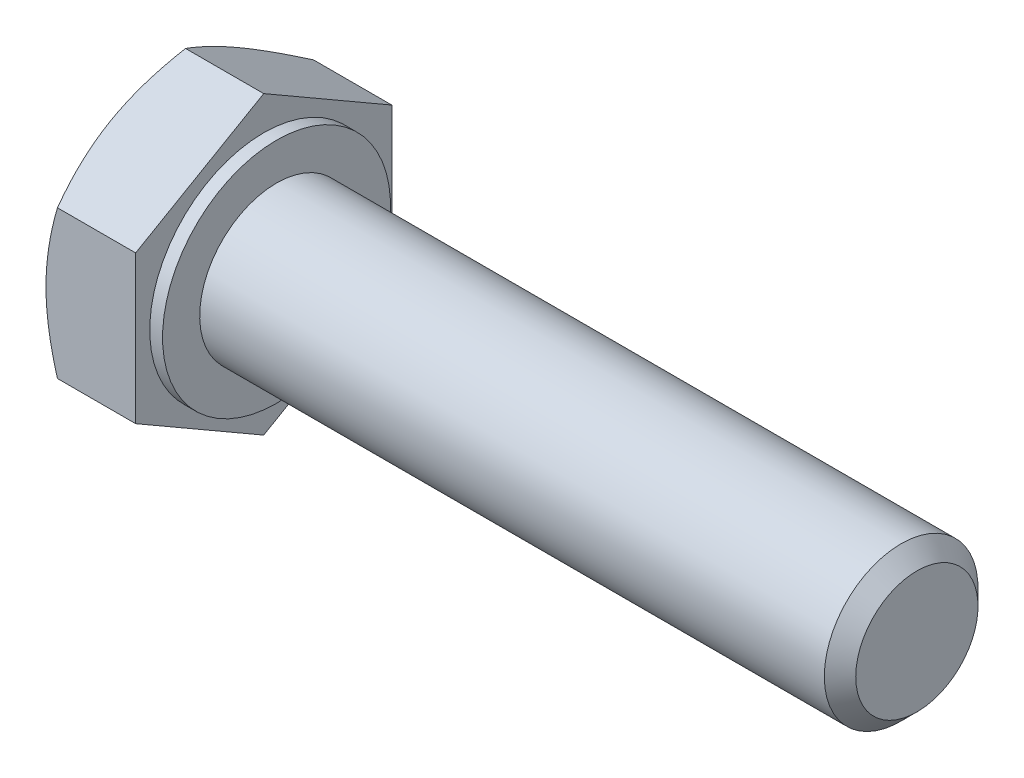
ISO-10303-21;
HEADER;
FILE_DESCRIPTION(('STEP AP214'),'2;1');
FILE_NAME('part.step','',(''),(''),'','','');
FILE_SCHEMA(('AUTOMOTIVE_DESIGN { 1 0 10303 214 1 1 1 1 }'));
ENDSEC;
DATA;
#1=APPLICATION_CONTEXT('core data for automotive mechanical design processes');
#2=APPLICATION_PROTOCOL_DEFINITION('international standard','automotive_design',2000,#1);
#3=PRODUCT_CONTEXT('',#1,'mechanical');
#4=PRODUCT('Part','Part','',(#3));
#5=PRODUCT_RELATED_PRODUCT_CATEGORY('part','',(#4));
#6=PRODUCT_DEFINITION_FORMATION('','',#4);
#7=PRODUCT_DEFINITION_CONTEXT('part definition',#1,'design');
#8=PRODUCT_DEFINITION('design','',#6,#7);
#9=PRODUCT_DEFINITION_SHAPE('','',#8);
#10=(LENGTH_UNIT() NAMED_UNIT(*) SI_UNIT(.MILLI.,.METRE.));
#11=(NAMED_UNIT(*) PLANE_ANGLE_UNIT() SI_UNIT($,.RADIAN.));
#12=(NAMED_UNIT(*) SI_UNIT($,.STERADIAN.) SOLID_ANGLE_UNIT());
#13=UNCERTAINTY_MEASURE_WITH_UNIT(LENGTH_MEASURE(1.E-05),#10,'distance_accuracy_value','');
#14=(GEOMETRIC_REPRESENTATION_CONTEXT(3) GLOBAL_UNCERTAINTY_ASSIGNED_CONTEXT((#13)) GLOBAL_UNIT_ASSIGNED_CONTEXT((#10,
#11,#12)) REPRESENTATION_CONTEXT('',''));
#15=CARTESIAN_POINT('',(0.,0.,0.));
#16=DIRECTION('',(0.,0.,1.));
#17=DIRECTION('',(1.,0.,0.));
#18=AXIS2_PLACEMENT_3D('',#15,#16,#17);
#19=CARTESIAN_POINT('',(-4.00009999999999,0.,0.));
#20=DIRECTION('',(1.,0.,0.));
#21=DIRECTION('',(0.,0.,-1.));
#22=AXIS2_PLACEMENT_3D('',#19,#20,#21);
#23=PLANE('',#22);
#24=CARTESIAN_POINT('',(-4.00010000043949,0.,0.));
#25=DIRECTION('',(1.,0.,0.));
#26=DIRECTION('',(0.,0.,-1.));
#27=AXIS2_PLACEMENT_3D('',#24,#25,#26);
#28=CIRCLE('',#27,5.00000000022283);
#29=CARTESIAN_POINT('',(-4.00010000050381,4.33012701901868,-2.5000000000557));
#30=VERTEX_POINT('',#29);
#31=CARTESIAN_POINT('',(-4.00010000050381,4.33012701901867,2.50000000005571));
#32=VERTEX_POINT('',#31);
#33=EDGE_CURVE('E322',#30,#32,#28,.T.);
#34=ORIENTED_EDGE('',*,*,#33,.F.);
#35=CARTESIAN_POINT('',(-4.00010000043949,0.,0.));
#36=DIRECTION('',(1.,0.,0.));
#37=DIRECTION('',(0.,0.,-1.));
#38=AXIS2_PLACEMENT_3D('',#35,#36,#37);
#39=CIRCLE('',#38,5.00000000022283);
#40=CARTESIAN_POINT('',(-4.00010000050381,0.,-5.00000000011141));
#41=VERTEX_POINT('',#40);
#42=EDGE_CURVE('E318',#41,#30,#39,.T.);
#43=ORIENTED_EDGE('',*,*,#42,.F.);
#44=CARTESIAN_POINT('',(-4.00010000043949,0.,0.));
#45=DIRECTION('',(1.,0.,0.));
#46=DIRECTION('',(0.,0.,-1.));
#47=AXIS2_PLACEMENT_3D('',#44,#45,#46);
#48=CIRCLE('',#47,5.00000000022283);
#49=CARTESIAN_POINT('',(-4.00010000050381,-4.33012701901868,-2.50000000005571));
#50=VERTEX_POINT('',#49);
#51=EDGE_CURVE('E314',#50,#41,#48,.T.);
#52=ORIENTED_EDGE('',*,*,#51,.F.);
#53=CARTESIAN_POINT('',(-4.00010000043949,0.,0.));
#54=DIRECTION('',(1.,0.,0.));
#55=DIRECTION('',(0.,0.,-1.));
#56=AXIS2_PLACEMENT_3D('',#53,#54,#55);
#57=CIRCLE('',#56,5.00000000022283);
#58=CARTESIAN_POINT('',(-4.00010000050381,-4.33012701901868,2.5000000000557));
#59=VERTEX_POINT('',#58);
#60=EDGE_CURVE('E90',#59,#50,#57,.T.);
#61=ORIENTED_EDGE('',*,*,#60,.F.);
#62=CARTESIAN_POINT('',(-4.00010000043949,0.,0.));
#63=DIRECTION('',(1.,0.,0.));
#64=DIRECTION('',(0.,0.,-1.));
#65=AXIS2_PLACEMENT_3D('',#62,#63,#64);
#66=CIRCLE('',#65,5.00000000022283);
#67=CARTESIAN_POINT('',(-4.00010000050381,0.,5.00000000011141));
#68=VERTEX_POINT('',#67);
#69=EDGE_CURVE('E87',#68,#59,#66,.T.);
#70=ORIENTED_EDGE('',*,*,#69,.F.);
#71=CARTESIAN_POINT('',(-4.00010000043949,0.,0.));
#72=DIRECTION('',(1.,0.,0.));
#73=DIRECTION('',(0.,0.,-1.));
#74=AXIS2_PLACEMENT_3D('',#71,#72,#73);
#75=CIRCLE('',#74,5.00000000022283);
#76=EDGE_CURVE('E19',#32,#68,#75,.T.);
#77=ORIENTED_EDGE('',*,*,#76,.F.);
#78=EDGE_LOOP('',(#34,#43,#52,#61,#70,#77));
#79=FACE_BOUND('',#78,.T.);
#80=ADVANCED_FACE('F16',(#79),#23,.F.);
#81=CARTESIAN_POINT('',(-3.55083852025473,0.,0.));
#82=DIRECTION('',(1.,0.,0.));
#83=DIRECTION('',(0.,0.,-1.));
#84=AXIS2_PLACEMENT_3D('',#81,#82,#83);
#85=CONICAL_SURFACE('',#84,5.77814370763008,1.04719754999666);
#86=ORIENTED_EDGE('',*,*,#76,.T.);
#87=CARTESIAN_POINT('',(-3.55351801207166,2.88675134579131,5.00000000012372));
#88=CARTESIAN_POINT('',(-3.62136800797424,2.65177101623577,5.00000000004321));
#89=CARTESIAN_POINT('',(-3.68353045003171,2.4149088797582,5.00000000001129));
#90=CARTESIAN_POINT('',(-3.79315279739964,1.93909669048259,4.99999999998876));
#91=CARTESIAN_POINT('',(-3.84068540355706,1.70016323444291,4.99999999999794));
#92=CARTESIAN_POINT('',(-3.89904737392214,1.33950809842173,5.00000000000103));
#93=CARTESIAN_POINT('',(-3.9163522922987,1.21883413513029,5.00000000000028));
#94=CARTESIAN_POINT('',(-3.94630746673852,0.976908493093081,4.99999999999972));
#95=CARTESIAN_POINT('',(-3.95895784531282,0.855656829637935,4.99999999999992));
#96=CARTESIAN_POINT('',(-3.97938167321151,0.612127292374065,5.00000000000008));
#97=CARTESIAN_POINT('',(-3.98713032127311,0.489847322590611,5.00000000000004));
#98=CARTESIAN_POINT('',(-3.99750021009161,0.2450468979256,4.99999999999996));
#99=CARTESIAN_POINT('',(-4.00012043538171,0.12252640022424,4.99999999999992));
#100=CARTESIAN_POINT('',(-4.00010000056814,1.07302371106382E-11,5.));
#101=B_SPLINE_CURVE_WITH_KNOTS('',3,(#87,#88,#89,#90,#91,#92,#93,#94,#95,#96,#97,#98,#99,#100),
.UNSPECIFIED.,.F.,.F.,(4,2,2,2,2,2,4),(0.,0.734036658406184,1.46436443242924,1.83000749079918,
2.19564092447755,2.56310985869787,2.93065154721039),.UNSPECIFIED.);
#102=CARTESIAN_POINT('',(-3.55351801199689,2.88675134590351,4.99999999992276));
#103=VERTEX_POINT('',#102);
#104=EDGE_CURVE('E108',#103,#68,#101,.T.);
#105=ORIENTED_EDGE('',*,*,#104,.F.);
#106=CARTESIAN_POINT('',(-4.00010000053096,4.33012701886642,2.4999999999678));
#107=CARTESIAN_POINT('',(-4.00012043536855,4.26886381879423,2.60611097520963));
#108=CARTESIAN_POINT('',(-3.99750021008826,4.20760356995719,2.71221683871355));
#109=CARTESIAN_POINT('',(-3.98713032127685,4.08520335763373,2.92422022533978));
#110=CARTESIAN_POINT('',(-3.97938167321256,4.02406337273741,3.03011778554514));
#111=CARTESIAN_POINT('',(-3.95895784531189,3.90229860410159,3.24102055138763));
#112=CARTESIAN_POINT('',(-3.94630746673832,3.84167277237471,3.34602757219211));
#113=CARTESIAN_POINT('',(-3.91635229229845,3.72070995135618,3.55554132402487));
#114=CARTESIAN_POINT('',(-3.89904737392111,3.66037296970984,3.66004804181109));
#115=CARTESIAN_POINT('',(-3.840685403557,3.48004540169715,3.97238455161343));
#116=CARTESIAN_POINT('',(-3.7931527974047,3.36057867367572,4.17930699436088));
#117=CARTESIAN_POINT('',(-3.68353045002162,3.1226725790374,4.5913724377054));
#118=CARTESIAN_POINT('',(-3.62136800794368,3.00424151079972,4.79650106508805));
#119=CARTESIAN_POINT('',(-3.55351801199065,2.88675134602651,4.99999999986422));
#120=B_SPLINE_CURVE_WITH_KNOTS('',3,(#106,#107,#108,#109,#110,#111,#112,#113,#114,#115,#116,
#117,#118,#119),.UNSPECIFIED.,.F.,.F.,(4,2,2,2,2,2,4),(0.,0.367541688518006,0.735010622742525,
1.10064405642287,1.46628711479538,2.19661488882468,2.93065154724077),.UNSPECIFIED.);
#121=EDGE_CURVE('E102',#32,#103,#120,.T.);
#122=ORIENTED_EDGE('',*,*,#121,.F.);
#123=EDGE_LOOP('',(#86,#105,#122));
#124=FACE_BOUND('',#123,.T.);
#125=ADVANCED_FACE('F107',(#124),#85,.T.);
#126=CARTESIAN_POINT('',(-3.55083852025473,0.,0.));
#127=DIRECTION('',(1.,0.,0.));
#128=DIRECTION('',(0.,0.,-1.));
#129=AXIS2_PLACEMENT_3D('',#126,#127,#128);
#130=CONICAL_SURFACE('',#129,5.77814370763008,1.04719754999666);
#131=CARTESIAN_POINT('',(-4.00010000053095,0.,4.9999999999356));
#132=CARTESIAN_POINT('',(-4.00012043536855,-0.122526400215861,4.99999999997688));
#133=CARTESIAN_POINT('',(-3.99750021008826,-0.245046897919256,4.9999999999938));
#134=CARTESIAN_POINT('',(-3.98713032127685,-0.489847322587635,5.00000000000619));
#135=CARTESIAN_POINT('',(-3.97938167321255,-0.612127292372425,5.00000000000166));
#136=CARTESIAN_POINT('',(-3.95895784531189,-0.855656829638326,4.99999999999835));
#137=CARTESIAN_POINT('',(-3.94630746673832,-0.97690849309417,4.99999999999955));
#138=CARTESIAN_POINT('',(-3.91635229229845,-1.21883413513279,5.00000000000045));
#139=CARTESIAN_POINT('',(-3.89904737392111,-1.33950809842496,5.00000000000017));
#140=CARTESIAN_POINT('',(-3.840685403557,-1.70016323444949,4.99999999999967));
#141=CARTESIAN_POINT('',(-3.7931527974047,-1.93909669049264,4.99999999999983));
#142=CARTESIAN_POINT('',(-3.68353045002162,-2.41490887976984,5.00000000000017));
#143=CARTESIAN_POINT('',(-3.62136800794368,-2.65177101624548,5.00000000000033));
#144=CARTESIAN_POINT('',(-3.55351801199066,-2.88675134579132,5.));
#145=B_SPLINE_CURVE_WITH_KNOTS('',3,(#131,#132,#133,#134,#135,#136,#137,#138,#139,#140,#141,
#142,#143,#144),.UNSPECIFIED.,.F.,.F.,(4,2,2,2,2,2,4),(0.,0.367541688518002,0.735010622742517,
1.10064405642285,1.46628711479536,2.19661488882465,2.93065154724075),.UNSPECIFIED.);
#146=CARTESIAN_POINT('',(-3.55351801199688,-2.88675134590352,4.99999999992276));
#147=VERTEX_POINT('',#146);
#148=EDGE_CURVE('E95',#68,#147,#145,.T.);
#149=ORIENTED_EDGE('',*,*,#148,.F.);
#150=ORIENTED_EDGE('',*,*,#69,.T.);
#151=CARTESIAN_POINT('',(-3.55351801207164,-2.88675134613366,4.99999999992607));
#152=CARTESIAN_POINT('',(-3.62136800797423,-3.00424151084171,4.79650106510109));
#153=CARTESIAN_POINT('',(-3.68353045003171,-3.12267257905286,4.59137243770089));
#154=CARTESIAN_POINT('',(-3.79315279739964,-3.36057867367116,4.17930699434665));
#155=CARTESIAN_POINT('',(-3.84068540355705,-3.48004540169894,3.97238455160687));
#156=CARTESIAN_POINT('',(-3.89904737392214,-3.66037296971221,3.66004804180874));
#157=CARTESIAN_POINT('',(-3.91635229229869,-3.72070995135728,3.55554132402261));
#158=CARTESIAN_POINT('',(-3.94630746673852,-3.84167277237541,3.34602757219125));
#159=CARTESIAN_POINT('',(-3.95895784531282,-3.90229860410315,3.24102055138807));
#160=CARTESIAN_POINT('',(-3.97938167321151,-4.02406337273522,3.03011778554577));
#161=CARTESIAN_POINT('',(-3.98713032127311,-4.08520335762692,2.92422022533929));
#162=CARTESIAN_POINT('',(-3.99750021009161,-4.20760356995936,2.71221683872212));
#163=CARTESIAN_POINT('',(-4.00012043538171,-4.26886381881,2.60611097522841));
#164=CARTESIAN_POINT('',(-4.00010000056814,-4.33012701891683,2.50000000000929));
#165=B_SPLINE_CURVE_WITH_KNOTS('',3,(#151,#152,#153,#154,#155,#156,#157,#158,#159,#160,#161,
#162,#163,#164),.UNSPECIFIED.,.F.,.F.,(4,2,2,2,2,2,4),(0.,0.734036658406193,1.46436443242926,
1.8300074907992,2.19564092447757,2.56310985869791,2.93065154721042),.UNSPECIFIED.);
#166=EDGE_CURVE('E97',#147,#59,#165,.T.);
#167=ORIENTED_EDGE('',*,*,#166,.F.);
#168=EDGE_LOOP('',(#149,#150,#167));
#169=FACE_BOUND('',#168,.T.);
#170=ADVANCED_FACE('F96',(#169),#130,.T.);
#171=CARTESIAN_POINT('',(-3.55083852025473,0.,0.));
#172=DIRECTION('',(1.,0.,0.));
#173=DIRECTION('',(0.,0.,-1.));
#174=AXIS2_PLACEMENT_3D('',#171,#172,#173);
#175=CONICAL_SURFACE('',#174,5.77814370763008,1.04719754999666);
#176=CARTESIAN_POINT('',(-4.00010000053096,-4.33012701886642,2.4999999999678));
#177=CARTESIAN_POINT('',(-4.00012043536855,-4.3913902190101,2.39388902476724));
#178=CARTESIAN_POINT('',(-3.99750021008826,-4.45265046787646,2.28778316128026));
#179=CARTESIAN_POINT('',(-3.98713032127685,-4.57505068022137,2.07577977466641));
#180=CARTESIAN_POINT('',(-3.97938167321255,-4.63619066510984,1.96988221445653));
#181=CARTESIAN_POINT('',(-3.95895784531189,-4.75795543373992,1.75897944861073));
#182=CARTESIAN_POINT('',(-3.94630746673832,-4.81858126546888,1.65397242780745));
#183=CARTESIAN_POINT('',(-3.91635229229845,-4.93954408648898,1.44445867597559));
#184=CARTESIAN_POINT('',(-3.89904737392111,-4.99988106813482,1.33995195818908));
#185=CARTESIAN_POINT('',(-3.840685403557,-5.18020863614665,1.02761544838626));
#186=CARTESIAN_POINT('',(-3.7931527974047,-5.29967536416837,0.820693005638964));
#187=CARTESIAN_POINT('',(-3.68353045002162,-5.53758145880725,0.408627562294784));
#188=CARTESIAN_POINT('',(-3.62136800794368,-5.65601252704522,0.203498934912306));
#189=CARTESIAN_POINT('',(-3.55351801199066,-5.77350269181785,1.35802455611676E-10));
#190=B_SPLINE_CURVE_WITH_KNOTS('',3,(#176,#177,#178,#179,#180,#181,#182,#183,#184,#185,#186,
#187,#188,#189),.UNSPECIFIED.,.F.,.F.,(4,2,2,2,2,2,4),(0.,0.367541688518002,0.735010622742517,
1.10064405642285,1.46628711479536,2.19661488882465,2.93065154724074),.UNSPECIFIED.);
#191=CARTESIAN_POINT('',(-3.55351801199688,-5.77350269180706,0.));
#192=VERTEX_POINT('',#191);
#193=EDGE_CURVE('E113',#59,#192,#190,.T.);
#194=ORIENTED_EDGE('',*,*,#193,.F.);
#195=ORIENTED_EDGE('',*,*,#60,.T.);
#196=CARTESIAN_POINT('',(-3.55351801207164,-5.773502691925,-1.97637812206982E-10));
#197=CARTESIAN_POINT('',(-3.62136800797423,-5.65601252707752,-0.203498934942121));
#198=CARTESIAN_POINT('',(-3.68353045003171,-5.53758145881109,-0.408627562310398));
#199=CARTESIAN_POINT('',(-3.79315279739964,-5.29967536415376,-0.82069300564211));
#200=CARTESIAN_POINT('',(-3.84068540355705,-5.18020863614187,-1.02761544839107));
#201=CARTESIAN_POINT('',(-3.89904737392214,-4.99988106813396,-1.33995195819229));
#202=CARTESIAN_POINT('',(-3.91635229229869,-4.93954408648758,-1.44445867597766));
#203=CARTESIAN_POINT('',(-3.94630746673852,-4.8185812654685,-1.65397242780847));
#204=CARTESIAN_POINT('',(-3.95895784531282,-4.7579554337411,-1.75897944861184));
#205=CARTESIAN_POINT('',(-3.97938167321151,-4.6361906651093,-1.96988221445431));
#206=CARTESIAN_POINT('',(-3.98713032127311,-4.57505068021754,-2.07577977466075));
#207=CARTESIAN_POINT('',(-3.99750021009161,-4.45265046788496,-2.28778316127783));
#208=CARTESIAN_POINT('',(-4.00012043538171,-4.39139021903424,-2.39388902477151));
#209=CARTESIAN_POINT('',(-4.00010000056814,-4.33012701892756,-2.4999999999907));
#210=B_SPLINE_CURVE_WITH_KNOTS('',3,(#196,#197,#198,#199,#200,#201,#202,#203,#204,#205,#206,
#207,#208,#209),.UNSPECIFIED.,.F.,.F.,(4,2,2,2,2,2,4),(0.,0.734036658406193,1.46436443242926,
1.8300074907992,2.19564092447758,2.5631098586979,2.93065154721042),.UNSPECIFIED.);
#211=EDGE_CURVE('E207',#192,#50,#210,.T.);
#212=ORIENTED_EDGE('',*,*,#211,.F.);
#213=EDGE_LOOP('',(#194,#195,#212));
#214=FACE_BOUND('',#213,.T.);
#215=ADVANCED_FACE('F215',(#214),#175,.T.);
#216=CARTESIAN_POINT('',(-3.55083852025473,0.,0.));
#217=DIRECTION('',(1.,0.,0.));
#218=DIRECTION('',(0.,0.,-1.));
#219=AXIS2_PLACEMENT_3D('',#216,#217,#218);
#220=CONICAL_SURFACE('',#219,5.77814370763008,1.04719754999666);
#221=CARTESIAN_POINT('',(-4.00010000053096,-4.33012701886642,-2.4999999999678));
#222=CARTESIAN_POINT('',(-4.00012043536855,-4.26886381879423,-2.60611097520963));
#223=CARTESIAN_POINT('',(-3.99750021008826,-4.2076035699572,-2.71221683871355));
#224=CARTESIAN_POINT('',(-3.98713032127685,-4.08520335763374,-2.92422022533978));
#225=CARTESIAN_POINT('',(-3.97938167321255,-4.02406337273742,-3.03011778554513));
#226=CARTESIAN_POINT('',(-3.95895784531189,-3.9022986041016,-3.24102055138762));
#227=CARTESIAN_POINT('',(-3.94630746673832,-3.84167277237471,-3.3460275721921));
#228=CARTESIAN_POINT('',(-3.91635229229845,-3.72070995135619,-3.55554132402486));
#229=CARTESIAN_POINT('',(-3.89904737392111,-3.66037296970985,-3.66004804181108));
#230=CARTESIAN_POINT('',(-3.84068540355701,-3.48004540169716,-3.97238455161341));
#231=CARTESIAN_POINT('',(-3.7931527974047,-3.36057867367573,-4.17930699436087));
#232=CARTESIAN_POINT('',(-3.68353045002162,-3.12267257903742,-4.59137243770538));
#233=CARTESIAN_POINT('',(-3.62136800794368,-3.00424151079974,-4.79650106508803));
#234=CARTESIAN_POINT('',(-3.55351801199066,-2.88675134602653,-4.9999999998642));
#235=B_SPLINE_CURVE_WITH_KNOTS('',3,(#221,#222,#223,#224,#225,#226,#227,#228,#229,#230,#231,
#232,#233,#234),.UNSPECIFIED.,.F.,.F.,(4,2,2,2,2,2,4),(0.,0.367541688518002,0.735010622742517,
1.10064405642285,1.46628711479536,2.19661488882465,2.93065154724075),.UNSPECIFIED.);
#236=CARTESIAN_POINT('',(-3.55351801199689,-2.88675134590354,-4.99999999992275));
#237=VERTEX_POINT('',#236);
#238=EDGE_CURVE('E219',#50,#237,#235,.T.);
#239=ORIENTED_EDGE('',*,*,#238,.F.);
#240=ORIENTED_EDGE('',*,*,#51,.T.);
#241=CARTESIAN_POINT('',(-3.55351801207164,-2.88675134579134,-5.00000000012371));
#242=CARTESIAN_POINT('',(-3.62136800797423,-2.65177101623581,-5.00000000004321));
#243=CARTESIAN_POINT('',(-3.68353045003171,-2.41490887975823,-5.00000000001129));
#244=CARTESIAN_POINT('',(-3.79315279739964,-1.93909669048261,-4.99999999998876));
#245=CARTESIAN_POINT('',(-3.84068540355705,-1.70016323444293,-4.99999999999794));
#246=CARTESIAN_POINT('',(-3.89904737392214,-1.33950809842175,-5.00000000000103));
#247=CARTESIAN_POINT('',(-3.91635229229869,-1.2188341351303,-5.00000000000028));
#248=CARTESIAN_POINT('',(-3.94630746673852,-0.976908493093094,-4.99999999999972));
#249=CARTESIAN_POINT('',(-3.95895784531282,-0.855656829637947,-4.99999999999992));
#250=CARTESIAN_POINT('',(-3.97938167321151,-0.612127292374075,-5.00000000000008));
#251=CARTESIAN_POINT('',(-3.98713032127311,-0.489847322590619,-5.00000000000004));
#252=CARTESIAN_POINT('',(-3.99750021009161,-0.245046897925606,-4.99999999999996));
#253=CARTESIAN_POINT('',(-4.00012043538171,-0.122526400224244,-4.99999999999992));
#254=CARTESIAN_POINT('',(-4.00010000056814,-1.07329188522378E-11,-5.));
#255=B_SPLINE_CURVE_WITH_KNOTS('',3,(#241,#242,#243,#244,#245,#246,#247,#248,#249,#250,#251,
#252,#253,#254),.UNSPECIFIED.,.F.,.F.,(4,2,2,2,2,2,4),(0.,0.734036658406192,1.46436443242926,
1.8300074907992,2.19564092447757,2.5631098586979,2.93065154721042),.UNSPECIFIED.);
#256=EDGE_CURVE('E201',#237,#41,#255,.T.);
#257=ORIENTED_EDGE('',*,*,#256,.F.);
#258=EDGE_LOOP('',(#239,#240,#257));
#259=FACE_BOUND('',#258,.T.);
#260=ADVANCED_FACE('F212',(#259),#220,.T.);
#261=CARTESIAN_POINT('',(-3.55083852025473,0.,0.));
#262=DIRECTION('',(1.,0.,0.));
#263=DIRECTION('',(0.,0.,-1.));
#264=AXIS2_PLACEMENT_3D('',#261,#262,#263);
#265=CONICAL_SURFACE('',#264,5.77814370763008,1.04719754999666);
#266=ORIENTED_EDGE('',*,*,#42,.T.);
#267=CARTESIAN_POINT('',(-3.55351801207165,2.88675134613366,-4.99999999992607));
#268=CARTESIAN_POINT('',(-3.62136800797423,3.00424151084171,-4.79650106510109));
#269=CARTESIAN_POINT('',(-3.68353045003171,3.12267257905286,-4.59137243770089));
#270=CARTESIAN_POINT('',(-3.79315279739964,3.36057867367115,-4.17930699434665));
#271=CARTESIAN_POINT('',(-3.84068540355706,3.48004540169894,-3.97238455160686));
#272=CARTESIAN_POINT('',(-3.89904737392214,3.66037296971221,-3.66004804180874));
#273=CARTESIAN_POINT('',(-3.9163522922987,3.72070995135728,-3.55554132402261));
#274=CARTESIAN_POINT('',(-3.94630746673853,3.8416727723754,-3.34602757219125));
#275=CARTESIAN_POINT('',(-3.95895784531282,3.90229860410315,-3.24102055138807));
#276=CARTESIAN_POINT('',(-3.97938167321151,4.02406337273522,-3.03011778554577));
#277=CARTESIAN_POINT('',(-3.98713032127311,4.08520335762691,-2.92422022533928));
#278=CARTESIAN_POINT('',(-3.99750021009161,4.20760356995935,-2.71221683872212));
#279=CARTESIAN_POINT('',(-4.00012043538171,4.26886381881,-2.60611097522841));
#280=CARTESIAN_POINT('',(-4.00010000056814,4.33012701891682,-2.50000000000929));
#281=B_SPLINE_CURVE_WITH_KNOTS('',3,(#267,#268,#269,#270,#271,#272,#273,#274,#275,#276,#277,
#278,#279,#280),.UNSPECIFIED.,.F.,.F.,(4,2,2,2,2,2,4),(0.,0.734036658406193,1.46436443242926,
1.8300074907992,2.19564092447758,2.56310985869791,2.93065154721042),.UNSPECIFIED.);
#282=CARTESIAN_POINT('',(-3.55351801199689,2.88675134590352,-4.99999999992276));
#283=VERTEX_POINT('',#282);
#284=EDGE_CURVE('E173',#283,#30,#281,.T.);
#285=ORIENTED_EDGE('',*,*,#284,.F.);
#286=CARTESIAN_POINT('',(-4.00010000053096,0.,-4.9999999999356));
#287=CARTESIAN_POINT('',(-4.00012043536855,0.122526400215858,-4.99999999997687));
#288=CARTESIAN_POINT('',(-3.99750021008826,0.245046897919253,-4.9999999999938));
#289=CARTESIAN_POINT('',(-3.98713032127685,0.489847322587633,-5.00000000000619));
#290=CARTESIAN_POINT('',(-3.97938167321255,0.612127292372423,-5.00000000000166));
#291=CARTESIAN_POINT('',(-3.95895784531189,0.855656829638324,-4.99999999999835));
#292=CARTESIAN_POINT('',(-3.94630746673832,0.976908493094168,-4.99999999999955));
#293=CARTESIAN_POINT('',(-3.91635229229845,1.21883413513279,-5.00000000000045));
#294=CARTESIAN_POINT('',(-3.89904737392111,1.33950809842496,-5.00000000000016));
#295=CARTESIAN_POINT('',(-3.840685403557,1.70016323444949,-4.99999999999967));
#296=CARTESIAN_POINT('',(-3.7931527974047,1.93909669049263,-4.99999999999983));
#297=CARTESIAN_POINT('',(-3.68353045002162,2.41490887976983,-5.00000000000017));
#298=CARTESIAN_POINT('',(-3.62136800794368,2.65177101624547,-5.00000000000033));
#299=CARTESIAN_POINT('',(-3.55351801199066,2.88675134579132,-5.));
#300=B_SPLINE_CURVE_WITH_KNOTS('',3,(#286,#287,#288,#289,#290,#291,#292,#293,#294,#295,#296,
#297,#298,#299),.UNSPECIFIED.,.F.,.F.,(4,2,2,2,2,2,4),(0.,0.367541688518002,0.735010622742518,
1.10064405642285,1.46628711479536,2.19661488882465,2.93065154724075),.UNSPECIFIED.);
#301=EDGE_CURVE('E196',#41,#283,#300,.T.);
#302=ORIENTED_EDGE('',*,*,#301,.F.);
#303=EDGE_LOOP('',(#266,#285,#302));
#304=FACE_BOUND('',#303,.T.);
#305=ADVANCED_FACE('F158',(#304),#265,.T.);
#306=CARTESIAN_POINT('',(-3.55083852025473,0.,0.));
#307=DIRECTION('',(1.,0.,0.));
#308=DIRECTION('',(0.,0.,-1.));
#309=AXIS2_PLACEMENT_3D('',#306,#307,#308);
#310=CONICAL_SURFACE('',#309,5.77814370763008,1.04719754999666);
#311=ORIENTED_EDGE('',*,*,#33,.T.);
#312=CARTESIAN_POINT('',(-3.55351801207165,5.77350269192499,1.9765135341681E-10));
#313=CARTESIAN_POINT('',(-3.62136800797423,5.65601252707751,0.203498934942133));
#314=CARTESIAN_POINT('',(-3.68353045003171,5.53758145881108,0.408627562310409));
#315=CARTESIAN_POINT('',(-3.79315279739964,5.29967536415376,0.820693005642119));
#316=CARTESIAN_POINT('',(-3.84068540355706,5.18020863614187,1.02761544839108));
#317=CARTESIAN_POINT('',(-3.89904737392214,4.99988106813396,1.3399519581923));
#318=CARTESIAN_POINT('',(-3.9163522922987,4.93954408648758,1.44445867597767));
#319=CARTESIAN_POINT('',(-3.94630746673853,4.81858126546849,1.65397242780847));
#320=CARTESIAN_POINT('',(-3.95895784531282,4.75795543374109,1.75897944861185));
#321=CARTESIAN_POINT('',(-3.97938167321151,4.63619066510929,1.96988221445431));
#322=CARTESIAN_POINT('',(-3.98713032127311,4.57505068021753,2.07577977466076));
#323=CARTESIAN_POINT('',(-3.99750021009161,4.45265046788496,2.28778316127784));
#324=CARTESIAN_POINT('',(-4.00012043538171,4.39139021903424,2.39388902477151));
#325=CARTESIAN_POINT('',(-4.00010000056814,4.33012701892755,2.49999999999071));
#326=B_SPLINE_CURVE_WITH_KNOTS('',3,(#312,#313,#314,#315,#316,#317,#318,#319,#320,#321,#322,
#323,#324,#325),.UNSPECIFIED.,.F.,.F.,(4,2,2,2,2,2,4),(0.,0.734036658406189,1.46436443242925,
1.8300074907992,2.19564092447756,2.56310985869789,2.93065154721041),.UNSPECIFIED.);
#327=CARTESIAN_POINT('',(-3.55351801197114,5.77350269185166,7.724138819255E-11));
#328=VERTEX_POINT('',#327);
#329=EDGE_CURVE('E143',#328,#32,#326,.T.);
#330=ORIENTED_EDGE('',*,*,#329,.F.);
#331=CARTESIAN_POINT('',(-4.00010000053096,4.33012701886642,-2.4999999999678));
#332=CARTESIAN_POINT('',(-4.00012043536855,4.39139021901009,-2.39388902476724));
#333=CARTESIAN_POINT('',(-3.99750021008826,4.45265046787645,-2.28778316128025));
#334=CARTESIAN_POINT('',(-3.98713032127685,4.57505068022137,-2.07577977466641));
#335=CARTESIAN_POINT('',(-3.97938167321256,4.63619066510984,-1.96988221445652));
#336=CARTESIAN_POINT('',(-3.95895784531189,4.75795543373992,-1.75897944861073));
#337=CARTESIAN_POINT('',(-3.94630746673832,4.81858126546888,-1.65397242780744));
#338=CARTESIAN_POINT('',(-3.91635229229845,4.93954408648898,-1.44445867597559));
#339=CARTESIAN_POINT('',(-3.89904737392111,4.99988106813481,-1.33995195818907));
#340=CARTESIAN_POINT('',(-3.84068540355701,5.18020863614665,-1.02761544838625));
#341=CARTESIAN_POINT('',(-3.7931527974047,5.29967536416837,-0.820693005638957));
#342=CARTESIAN_POINT('',(-3.68353045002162,5.53758145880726,-0.408627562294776));
#343=CARTESIAN_POINT('',(-3.62136800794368,5.65601252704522,-0.203498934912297));
#344=CARTESIAN_POINT('',(-3.55351801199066,5.77350269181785,-1.35791371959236E-10));
#345=B_SPLINE_CURVE_WITH_KNOTS('',3,(#331,#332,#333,#334,#335,#336,#337,#338,#339,#340,#341,
#342,#343,#344),.UNSPECIFIED.,.F.,.F.,(4,2,2,2,2,2,4),(0.,0.367541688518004,0.73501062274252,
1.10064405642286,1.46628711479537,2.19661488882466,2.93065154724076),.UNSPECIFIED.);
#346=EDGE_CURVE('E164',#30,#328,#345,.T.);
#347=ORIENTED_EDGE('',*,*,#346,.F.);
#348=EDGE_LOOP('',(#311,#330,#347));
#349=FACE_BOUND('',#348,.T.);
#350=ADVANCED_FACE('F152',(#349),#310,.T.);
#351=CARTESIAN_POINT('',(-0.500099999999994,5.77350269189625,0.));
#352=DIRECTION('',(0.,0.866025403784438,0.500000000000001));
#353=DIRECTION('',(0.,-0.500000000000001,0.866025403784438));
#354=AXIS2_PLACEMENT_3D('',#351,#352,#353);
#355=PLANE('',#354);
#356=DIRECTION('',(0.,-0.5,0.866025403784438));
#357=VECTOR('',#356,1.);
#358=CARTESIAN_POINT('',(-0.500099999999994,5.77350269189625,0.));
#359=LINE('',#358,#357);
#360=CARTESIAN_POINT('',(-0.500099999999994,5.77350269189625,0.));
#361=VERTEX_POINT('',#360);
#362=CARTESIAN_POINT('',(-0.500099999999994,2.88675134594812,5.));
#363=VERTEX_POINT('',#362);
#364=EDGE_CURVE('E283',#361,#363,#359,.T.);
#365=ORIENTED_EDGE('',*,*,#364,.F.);
#366=DIRECTION('',(1.,0.,0.));
#367=VECTOR('',#366,1.);
#368=CARTESIAN_POINT('',(-0.500099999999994,5.77350269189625,0.));
#369=LINE('',#368,#367);
#370=EDGE_CURVE('E172',#328,#361,#369,.T.);
#371=ORIENTED_EDGE('',*,*,#370,.F.);
#372=ORIENTED_EDGE('',*,*,#329,.T.);
#373=ORIENTED_EDGE('',*,*,#121,.T.);
#374=DIRECTION('',(1.,0.,0.));
#375=VECTOR('',#374,1.);
#376=CARTESIAN_POINT('',(-0.500099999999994,2.88675134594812,5.));
#377=LINE('',#376,#375);
#378=EDGE_CURVE('E101',#363,#103,#377,.F.);
#379=ORIENTED_EDGE('',*,*,#378,.F.);
#380=EDGE_LOOP('',(#365,#371,#372,#373,#379));
#381=FACE_BOUND('',#380,.T.);
#382=ADVANCED_FACE('F149',(#381),#355,.T.);
#383=CARTESIAN_POINT('',(-0.500099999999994,2.88675134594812,5.));
#384=DIRECTION('',(0.,0.,1.));
#385=DIRECTION('',(1.,0.,0.));
#386=AXIS2_PLACEMENT_3D('',#383,#384,#385);
#387=PLANE('',#386);
#388=ORIENTED_EDGE('',*,*,#378,.T.);
#389=ORIENTED_EDGE('',*,*,#104,.T.);
#390=ORIENTED_EDGE('',*,*,#148,.T.);
#391=DIRECTION('',(1.,0.,0.));
#392=VECTOR('',#391,1.);
#393=CARTESIAN_POINT('',(-0.500099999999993,-2.88675134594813,5.));
#394=LINE('',#393,#392);
#395=CARTESIAN_POINT('',(-0.500099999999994,-2.88675134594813,5.));
#396=VERTEX_POINT('',#395);
#397=EDGE_CURVE('E115',#396,#147,#394,.F.);
#398=ORIENTED_EDGE('',*,*,#397,.F.);
#399=DIRECTION('',(0.,1.,0.));
#400=VECTOR('',#399,1.);
#401=CARTESIAN_POINT('',(-0.500099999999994,0.,5.));
#402=LINE('',#401,#400);
#403=EDGE_CURVE('E279',#363,#396,#402,.F.);
#404=ORIENTED_EDGE('',*,*,#403,.F.);
#405=EDGE_LOOP('',(#388,#389,#390,#398,#404));
#406=FACE_BOUND('',#405,.T.);
#407=ADVANCED_FACE('F111',(#406),#387,.T.);
#408=CARTESIAN_POINT('',(-0.500099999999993,-2.88675134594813,5.));
#409=DIRECTION('',(0.,-0.866025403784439,0.5));
#410=DIRECTION('',(0.,-0.5,-0.866025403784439));
#411=AXIS2_PLACEMENT_3D('',#408,#409,#410);
#412=PLANE('',#411);
#413=ORIENTED_EDGE('',*,*,#397,.T.);
#414=ORIENTED_EDGE('',*,*,#166,.T.);
#415=ORIENTED_EDGE('',*,*,#193,.T.);
#416=DIRECTION('',(1.,0.,0.));
#417=VECTOR('',#416,1.);
#418=CARTESIAN_POINT('',(-0.500099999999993,-5.77350269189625,0.));
#419=LINE('',#418,#417);
#420=CARTESIAN_POINT('',(-0.500099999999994,-5.77350269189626,0.));
#421=VERTEX_POINT('',#420);
#422=EDGE_CURVE('E224',#421,#192,#419,.F.);
#423=ORIENTED_EDGE('',*,*,#422,.F.);
#424=DIRECTION('',(0.,-0.499999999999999,-0.866025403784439));
#425=VECTOR('',#424,1.);
#426=CARTESIAN_POINT('',(-0.500099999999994,-2.88675134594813,5.));
#427=LINE('',#426,#425);
#428=EDGE_CURVE('E282',#396,#421,#427,.T.);
#429=ORIENTED_EDGE('',*,*,#428,.F.);
#430=EDGE_LOOP('',(#413,#414,#415,#423,#429));
#431=FACE_BOUND('',#430,.T.);
#432=ADVANCED_FACE('F228',(#431),#412,.T.);
#433=CARTESIAN_POINT('',(-0.500099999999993,-5.77350269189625,0.));
#434=DIRECTION('',(0.,-0.866025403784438,-0.5));
#435=DIRECTION('',(0.,0.5,-0.866025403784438));
#436=AXIS2_PLACEMENT_3D('',#433,#434,#435);
#437=PLANE('',#436);
#438=ORIENTED_EDGE('',*,*,#422,.T.);
#439=ORIENTED_EDGE('',*,*,#211,.T.);
#440=ORIENTED_EDGE('',*,*,#238,.T.);
#441=DIRECTION('',(-1.,0.,0.));
#442=VECTOR('',#441,1.);
#443=CARTESIAN_POINT('',(-0.500099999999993,-2.88675134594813,-5.));
#444=LINE('',#443,#442);
#445=CARTESIAN_POINT('',(-0.500099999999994,-2.88675134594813,-5.));
#446=VERTEX_POINT('',#445);
#447=EDGE_CURVE('E299',#446,#237,#444,.T.);
#448=ORIENTED_EDGE('',*,*,#447,.F.);
#449=DIRECTION('',(0.,0.5,-0.866025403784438));
#450=VECTOR('',#449,1.);
#451=CARTESIAN_POINT('',(-0.500099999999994,-5.77350269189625,0.));
#452=LINE('',#451,#450);
#453=EDGE_CURVE('E286',#421,#446,#452,.T.);
#454=ORIENTED_EDGE('',*,*,#453,.F.);
#455=EDGE_LOOP('',(#438,#439,#440,#448,#454));
#456=FACE_BOUND('',#455,.T.);
#457=ADVANCED_FACE('F193',(#456),#437,.T.);
#458=CARTESIAN_POINT('',(-0.500099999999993,-2.88675134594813,-5.));
#459=DIRECTION('',(0.,0.,-1.));
#460=DIRECTION('',(-1.,0.,0.));
#461=AXIS2_PLACEMENT_3D('',#458,#459,#460);
#462=PLANE('',#461);
#463=DIRECTION('',(0.,1.,0.));
#464=VECTOR('',#463,1.);
#465=CARTESIAN_POINT('',(-0.500099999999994,0.,-5.));
#466=LINE('',#465,#464);
#467=CARTESIAN_POINT('',(-0.500099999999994,2.88675134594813,-5.));
#468=VERTEX_POINT('',#467);
#469=EDGE_CURVE('E289',#446,#468,#466,.T.);
#470=ORIENTED_EDGE('',*,*,#469,.F.);
#471=ORIENTED_EDGE('',*,*,#447,.T.);
#472=ORIENTED_EDGE('',*,*,#256,.T.);
#473=ORIENTED_EDGE('',*,*,#301,.T.);
#474=DIRECTION('',(1.,0.,0.));
#475=VECTOR('',#474,1.);
#476=CARTESIAN_POINT('',(-0.500099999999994,2.88675134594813,-5.));
#477=LINE('',#476,#475);
#478=EDGE_CURVE('E34',#468,#283,#477,.F.);
#479=ORIENTED_EDGE('',*,*,#478,.F.);
#480=EDGE_LOOP('',(#470,#471,#472,#473,#479));
#481=FACE_BOUND('',#480,.T.);
#482=ADVANCED_FACE('F186',(#481),#462,.T.);
#483=CARTESIAN_POINT('',(-0.500099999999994,2.88675134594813,-5.));
#484=DIRECTION('',(0.,0.866025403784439,-0.5));
#485=DIRECTION('',(0.,0.5,0.866025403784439));
#486=AXIS2_PLACEMENT_3D('',#483,#484,#485);
#487=PLANE('',#486);
#488=DIRECTION('',(0.,0.5,0.866025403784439));
#489=VECTOR('',#488,1.);
#490=CARTESIAN_POINT('',(-0.500099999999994,2.88675134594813,-5.));
#491=LINE('',#490,#489);
#492=EDGE_CURVE('E275',#468,#361,#491,.T.);
#493=ORIENTED_EDGE('',*,*,#492,.F.);
#494=ORIENTED_EDGE('',*,*,#478,.T.);
#495=ORIENTED_EDGE('',*,*,#284,.T.);
#496=ORIENTED_EDGE('',*,*,#346,.T.);
#497=ORIENTED_EDGE('',*,*,#370,.T.);
#498=EDGE_LOOP('',(#493,#494,#495,#496,#497));
#499=FACE_BOUND('',#498,.T.);
#500=ADVANCED_FACE('F180',(#499),#487,.T.);
#501=CARTESIAN_POINT('',(-0.500099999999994,0.,0.));
#502=DIRECTION('',(1.,0.,0.));
#503=DIRECTION('',(0.,0.,-1.));
#504=AXIS2_PLACEMENT_3D('',#501,#502,#503);
#505=PLANE('',#504);
#506=CARTESIAN_POINT('',(-0.500099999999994,0.,0.));
#507=DIRECTION('',(1.,0.,0.));
#508=DIRECTION('',(0.,1.,0.));
#509=AXIS2_PLACEMENT_3D('',#506,#507,#508);
#510=CIRCLE('',#509,4.45);
#511=CARTESIAN_POINT('',(-0.500099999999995,4.45,0.));
#512=VERTEX_POINT('',#511);
#513=EDGE_CURVE('E174',#512,#512,#510,.T.);
#514=ORIENTED_EDGE('',*,*,#513,.F.);
#515=EDGE_LOOP('',(#514));
#516=FACE_BOUND('',#515,.T.);
#517=ORIENTED_EDGE('',*,*,#469,.T.);
#518=ORIENTED_EDGE('',*,*,#492,.T.);
#519=ORIENTED_EDGE('',*,*,#364,.T.);
#520=ORIENTED_EDGE('',*,*,#403,.T.);
#521=ORIENTED_EDGE('',*,*,#428,.T.);
#522=ORIENTED_EDGE('',*,*,#453,.T.);
#523=EDGE_LOOP('',(#517,#518,#519,#520,#521,#522));
#524=FACE_BOUND('',#523,.T.);
#525=ADVANCED_FACE('F185',(#516,#524),#505,.T.);
#526=CARTESIAN_POINT('',(-0.250049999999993,0.,0.));
#527=DIRECTION('',(1.,0.,0.));
#528=DIRECTION('',(0.,1.,0.));
#529=AXIS2_PLACEMENT_3D('',#526,#527,#528);
#530=CYLINDRICAL_SURFACE('',#529,4.45);
#531=ORIENTED_EDGE('',*,*,#513,.T.);
#532=EDGE_LOOP('',(#531));
#533=FACE_BOUND('',#532,.T.);
#534=CARTESIAN_POINT('',(0.,0.,0.));
#535=DIRECTION('',(1.,0.,0.));
#536=DIRECTION('',(0.,1.,0.));
#537=AXIS2_PLACEMENT_3D('',#534,#535,#536);
#538=CIRCLE('',#537,4.45);
#539=CARTESIAN_POINT('',(0.,4.45,0.));
#540=VERTEX_POINT('',#539);
#541=EDGE_CURVE('E270',#540,#540,#538,.T.);
#542=ORIENTED_EDGE('',*,*,#541,.F.);
#543=EDGE_LOOP('',(#542));
#544=FACE_BOUND('',#543,.T.);
#545=ADVANCED_FACE('F257',(#533,#544),#530,.T.);
#546=CARTESIAN_POINT('',(25.,1.5,0.));
#547=DIRECTION('',(1.,0.,0.));
#548=DIRECTION('',(0.,0.,-1.));
#549=AXIS2_PLACEMENT_3D('',#546,#547,#548);
#550=PLANE('',#549);
#551=CARTESIAN_POINT('',(25.0000000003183,0.,0.));
#552=DIRECTION('',(-1.,0.,0.));
#553=DIRECTION('',(0.,0.,1.));
#554=AXIS2_PLACEMENT_3D('',#551,#552,#553);
#555=CIRCLE('',#554,2.38655000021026);
#556=CARTESIAN_POINT('',(25.0000000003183,0.,2.38655000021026));
#557=VERTEX_POINT('',#556);
#558=EDGE_CURVE('E272',#557,#557,#555,.T.);
#559=ORIENTED_EDGE('',*,*,#558,.F.);
#560=EDGE_LOOP('',(#559));
#561=FACE_BOUND('',#560,.T.);
#562=ADVANCED_FACE('F254',(#561),#550,.T.);
#563=CARTESIAN_POINT('',(0.,3.725,0.));
#564=DIRECTION('',(1.,0.,0.));
#565=DIRECTION('',(0.,0.,-1.));
#566=AXIS2_PLACEMENT_3D('',#563,#564,#565);
#567=PLANE('',#566);
#568=CARTESIAN_POINT('',(0.,0.,0.));
#569=DIRECTION('',(1.,0.,0.));
#570=DIRECTION('',(0.,1.,0.));
#571=AXIS2_PLACEMENT_3D('',#568,#569,#570);
#572=CIRCLE('',#571,3.);
#573=CARTESIAN_POINT('',(0.,3.,0.));
#574=VERTEX_POINT('',#573);
#575=EDGE_CURVE('E25',#574,#574,#572,.T.);
#576=ORIENTED_EDGE('',*,*,#575,.F.);
#577=EDGE_LOOP('',(#576));
#578=FACE_BOUND('',#577,.T.);
#579=ORIENTED_EDGE('',*,*,#541,.T.);
#580=EDGE_LOOP('',(#579));
#581=FACE_BOUND('',#580,.T.);
#582=ADVANCED_FACE('F247',(#578,#581),#567,.T.);
#583=CARTESIAN_POINT('',(24.3864499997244,0.,0.));
#584=DIRECTION('',(-1.,0.,0.));
#585=DIRECTION('',(0.,0.,1.));
#586=AXIS2_PLACEMENT_3D('',#583,#584,#585);
#587=CONICAL_SURFACE('',#586,2.99999999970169,0.785316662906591);
#588=ORIENTED_EDGE('',*,*,#558,.T.);
#589=EDGE_LOOP('',(#588));
#590=FACE_BOUND('',#589,.T.);
#591=CARTESIAN_POINT('',(24.38645,0.,0.));
#592=DIRECTION('',(1.,0.,0.));
#593=DIRECTION('',(0.,1.,0.));
#594=AXIS2_PLACEMENT_3D('',#591,#592,#593);
#595=CIRCLE('',#594,3.);
#596=CARTESIAN_POINT('',(24.38645,3.,0.));
#597=VERTEX_POINT('',#596);
#598=EDGE_CURVE('E11',#597,#597,#595,.F.);
#599=ORIENTED_EDGE('',*,*,#598,.F.);
#600=EDGE_LOOP('',(#599));
#601=FACE_BOUND('',#600,.T.);
#602=ADVANCED_FACE('F241',(#590,#601),#587,.T.);
#603=CARTESIAN_POINT('',(13.,0.,0.));
#604=DIRECTION('',(1.,0.,0.));
#605=DIRECTION('',(0.,1.,0.));
#606=AXIS2_PLACEMENT_3D('',#603,#604,#605);
#607=CYLINDRICAL_SURFACE('',#606,3.);
#608=ORIENTED_EDGE('',*,*,#598,.T.);
#609=EDGE_LOOP('',(#608));
#610=FACE_BOUND('',#609,.T.);
#611=ORIENTED_EDGE('',*,*,#575,.T.);
#612=EDGE_LOOP('',(#611));
#613=FACE_BOUND('',#612,.T.);
#614=ADVANCED_FACE('F239',(#610,#613),#607,.T.);
#615=CLOSED_SHELL('',(#80,#125,#170,#215,#260,#305,#350,#382,#407,#432,#457,#482,#500,#525,#545,
#562,#582,#602,#614));
#616=MANIFOLD_SOLID_BREP('B1',#615);
#617=ADVANCED_BREP_SHAPE_REPRESENTATION('',(#18,#616),#14);
#618=SHAPE_DEFINITION_REPRESENTATION(#9,#617);
ENDSEC;
END-ISO-10303-21;
